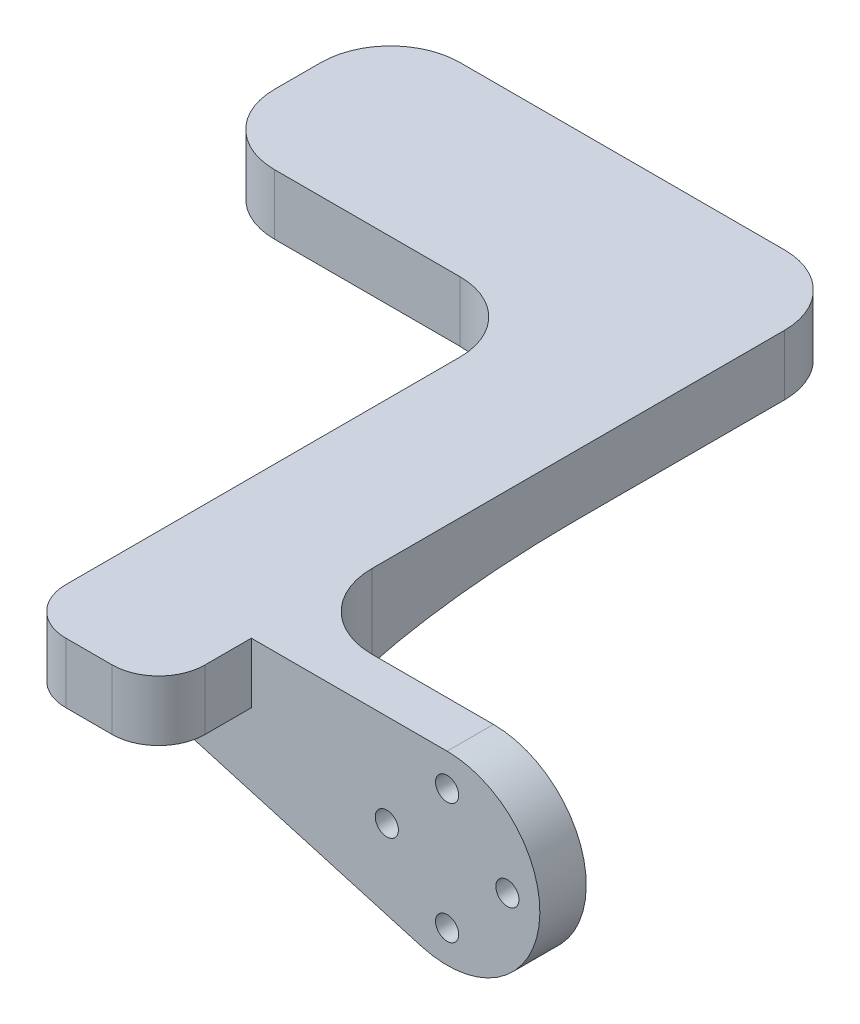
ISO-10303-21;
HEADER;
FILE_DESCRIPTION(('STEP AP214'),'2;1');
FILE_NAME('part.step','',(''),(''),'','','');
FILE_SCHEMA(('AUTOMOTIVE_DESIGN { 1 0 10303 214 1 1 1 1 }'));
ENDSEC;
DATA;
#1=APPLICATION_CONTEXT('core data for automotive mechanical design processes');
#2=APPLICATION_PROTOCOL_DEFINITION('international standard','automotive_design',2000,#1);
#3=PRODUCT_CONTEXT('',#1,'mechanical');
#4=PRODUCT('Part','Part','',(#3));
#5=PRODUCT_RELATED_PRODUCT_CATEGORY('part','',(#4));
#6=PRODUCT_DEFINITION_FORMATION('','',#4);
#7=PRODUCT_DEFINITION_CONTEXT('part definition',#1,'design');
#8=PRODUCT_DEFINITION('design','',#6,#7);
#9=PRODUCT_DEFINITION_SHAPE('','',#8);
#10=(LENGTH_UNIT() NAMED_UNIT(*) SI_UNIT(.MILLI.,.METRE.));
#11=(NAMED_UNIT(*) PLANE_ANGLE_UNIT() SI_UNIT($,.RADIAN.));
#12=(NAMED_UNIT(*) SI_UNIT($,.STERADIAN.) SOLID_ANGLE_UNIT());
#13=UNCERTAINTY_MEASURE_WITH_UNIT(LENGTH_MEASURE(1.E-05),#10,'distance_accuracy_value','');
#14=(GEOMETRIC_REPRESENTATION_CONTEXT(3) GLOBAL_UNCERTAINTY_ASSIGNED_CONTEXT((#13)) GLOBAL_UNIT_ASSIGNED_CONTEXT((#10,
#11,#12)) REPRESENTATION_CONTEXT('',''));
#15=CARTESIAN_POINT('',(0.,0.,0.));
#16=DIRECTION('',(0.,0.,1.));
#17=DIRECTION('',(1.,0.,0.));
#18=AXIS2_PLACEMENT_3D('',#15,#16,#17);
#19=CARTESIAN_POINT('',(0.,0.,5.));
#20=DIRECTION('',(0.,0.,-1.));
#21=DIRECTION('',(-1.,0.,0.));
#22=AXIS2_PLACEMENT_3D('',#19,#20,#21);
#23=CYLINDRICAL_SURFACE('',#22,10.);
#24=CARTESIAN_POINT('',(0.,0.,5.));
#25=DIRECTION('',(0.,0.,1.));
#26=DIRECTION('',(1.,0.,0.));
#27=AXIS2_PLACEMENT_3D('',#24,#25,#26);
#28=CIRCLE('',#27,10.);
#29=CARTESIAN_POINT('',(-2.76737364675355,-9.60945592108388,5.));
#30=VERTEX_POINT('',#29);
#31=CARTESIAN_POINT('',(0.,10.,5.));
#32=VERTEX_POINT('',#31);
#33=EDGE_CURVE('E449',#30,#32,#28,.T.);
#34=ORIENTED_EDGE('',*,*,#33,.F.);
#35=DIRECTION('',(0.,0.,1.));
#36=VECTOR('',#35,1.);
#37=CARTESIAN_POINT('',(-2.76737364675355,-9.60945592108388,-41.0909097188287));
#38=LINE('',#37,#36);
#39=CARTESIAN_POINT('',(-2.76737364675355,-9.60945592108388,0.));
#40=VERTEX_POINT('',#39);
#41=EDGE_CURVE('E452',#40,#30,#38,.T.);
#42=ORIENTED_EDGE('',*,*,#41,.F.);
#43=CARTESIAN_POINT('',(0.,0.,0.));
#44=DIRECTION('',(0.,0.,1.));
#45=DIRECTION('',(1.,0.,0.));
#46=AXIS2_PLACEMENT_3D('',#43,#44,#45);
#47=CIRCLE('',#46,10.);
#48=CARTESIAN_POINT('',(0.,10.,0.));
#49=VERTEX_POINT('',#48);
#50=EDGE_CURVE('E458',#40,#49,#47,.T.);
#51=ORIENTED_EDGE('',*,*,#50,.T.);
#52=DIRECTION('',(0.,0.,1.));
#53=VECTOR('',#52,1.);
#54=CARTESIAN_POINT('',(0.,10.,-41.0909097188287));
#55=LINE('',#54,#53);
#56=EDGE_CURVE('E455',#49,#32,#55,.T.);
#57=ORIENTED_EDGE('',*,*,#56,.T.);
#58=EDGE_LOOP('',(#34,#42,#51,#57));
#59=FACE_BOUND('',#58,.T.);
#60=ADVANCED_FACE('F44',(#59),#23,.T.);
#61=CARTESIAN_POINT('',(0.,0.,5.));
#62=DIRECTION('',(0.,0.,1.));
#63=DIRECTION('',(1.,0.,0.));
#64=AXIS2_PLACEMENT_3D('',#61,#62,#63);
#65=PLANE('',#64);
#66=DIRECTION('',(0.,-1.,0.));
#67=VECTOR('',#66,1.);
#68=CARTESIAN_POINT('',(-36.11,10.,5.));
#69=LINE('',#68,#67);
#70=CARTESIAN_POINT('',(-36.11,3.5,5.));
#71=VERTEX_POINT('',#70);
#72=CARTESIAN_POINT('',(-36.11,2.25067283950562,5.));
#73=VERTEX_POINT('',#72);
#74=EDGE_CURVE('E462',#71,#73,#69,.T.);
#75=ORIENTED_EDGE('',*,*,#74,.T.);
#76=CARTESIAN_POINT('',(-33.11,2.25067283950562,5.));
#77=DIRECTION('',(0.,0.,1.));
#78=DIRECTION('',(1.,0.,0.));
#79=AXIS2_PLACEMENT_3D('',#76,#77,#78);
#80=CIRCLE('',#79,3.);
#81=CARTESIAN_POINT('',(-33.9402120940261,-0.632163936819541,5.));
#82=VERTEX_POINT('',#81);
#83=EDGE_CURVE('E541',#73,#82,#80,.T.);
#84=ORIENTED_EDGE('',*,*,#83,.T.);
#85=DIRECTION('',(0.960945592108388,-0.276737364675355,0.));
#86=VECTOR('',#85,1.);
#87=CARTESIAN_POINT('',(-36.11,-0.00729881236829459,5.));
#88=LINE('',#87,#86);
#89=EDGE_CURVE('E278',#82,#30,#88,.T.);
#90=ORIENTED_EDGE('',*,*,#89,.T.);
#91=ORIENTED_EDGE('',*,*,#33,.T.);
#92=DIRECTION('',(-1.,0.,0.));
#93=VECTOR('',#92,1.);
#94=CARTESIAN_POINT('',(0.,10.,5.));
#95=LINE('',#94,#93);
#96=CARTESIAN_POINT('',(-21.11,10.,5.));
#97=VERTEX_POINT('',#96);
#98=EDGE_CURVE('E466',#32,#97,#95,.T.);
#99=ORIENTED_EDGE('',*,*,#98,.T.);
#100=DIRECTION('',(0.,1.,0.));
#101=VECTOR('',#100,1.);
#102=CARTESIAN_POINT('',(-21.11,0.,5.));
#103=LINE('',#102,#101);
#104=CARTESIAN_POINT('',(-21.11,3.5,5.));
#105=VERTEX_POINT('',#104);
#106=EDGE_CURVE('E273',#105,#97,#103,.T.);
#107=ORIENTED_EDGE('',*,*,#106,.F.);
#108=DIRECTION('',(-1.,0.,0.));
#109=VECTOR('',#108,1.);
#110=CARTESIAN_POINT('',(0.,3.5,5.));
#111=LINE('',#110,#109);
#112=EDGE_CURVE('E276',#105,#71,#111,.T.);
#113=ORIENTED_EDGE('',*,*,#112,.T.);
#114=EDGE_LOOP('',(#75,#84,#90,#91,#99,#107,#113));
#115=FACE_BOUND('',#114,.T.);
#116=CARTESIAN_POINT('',(0.,6.5,5.));
#117=DIRECTION('',(0.,0.,1.));
#118=DIRECTION('',(1.,0.,0.));
#119=AXIS2_PLACEMENT_3D('',#116,#117,#118);
#120=CIRCLE('',#119,1.25);
#121=CARTESIAN_POINT('',(1.25,6.5,5.));
#122=VERTEX_POINT('',#121);
#123=EDGE_CURVE('E479',#122,#122,#120,.T.);
#124=ORIENTED_EDGE('',*,*,#123,.F.);
#125=EDGE_LOOP('',(#124));
#126=FACE_BOUND('',#125,.T.);
#127=CARTESIAN_POINT('',(6.5,0.,5.));
#128=DIRECTION('',(0.,0.,1.));
#129=DIRECTION('',(1.,0.,0.));
#130=AXIS2_PLACEMENT_3D('',#127,#128,#129);
#131=CIRCLE('',#130,1.25);
#132=CARTESIAN_POINT('',(7.75,0.,5.));
#133=VERTEX_POINT('',#132);
#134=EDGE_CURVE('E482',#133,#133,#131,.T.);
#135=ORIENTED_EDGE('',*,*,#134,.F.);
#136=EDGE_LOOP('',(#135));
#137=FACE_BOUND('',#136,.T.);
#138=CARTESIAN_POINT('',(0.,-6.5,5.));
#139=DIRECTION('',(0.,0.,1.));
#140=DIRECTION('',(1.,0.,0.));
#141=AXIS2_PLACEMENT_3D('',#138,#139,#140);
#142=CIRCLE('',#141,1.25);
#143=CARTESIAN_POINT('',(1.25,-6.5,5.));
#144=VERTEX_POINT('',#143);
#145=EDGE_CURVE('E488',#144,#144,#142,.T.);
#146=ORIENTED_EDGE('',*,*,#145,.F.);
#147=EDGE_LOOP('',(#146));
#148=FACE_BOUND('',#147,.T.);
#149=CARTESIAN_POINT('',(-6.5,0.,5.));
#150=DIRECTION('',(0.,0.,1.));
#151=DIRECTION('',(1.,0.,0.));
#152=AXIS2_PLACEMENT_3D('',#149,#150,#151);
#153=CIRCLE('',#152,1.25);
#154=CARTESIAN_POINT('',(-5.25,0.,5.));
#155=VERTEX_POINT('',#154);
#156=EDGE_CURVE('E494',#155,#155,#153,.T.);
#157=ORIENTED_EDGE('',*,*,#156,.F.);
#158=EDGE_LOOP('',(#157));
#159=FACE_BOUND('',#158,.T.);
#160=ADVANCED_FACE('F314',(#115,#126,#137,#148,#159),#65,.T.);
#161=CARTESIAN_POINT('',(0.,0.,0.));
#162=DIRECTION('',(0.,0.,1.));
#163=DIRECTION('',(1.,0.,0.));
#164=AXIS2_PLACEMENT_3D('',#161,#162,#163);
#165=PLANE('',#164);
#166=CARTESIAN_POINT('',(0.,0.,0.));
#167=DIRECTION('',(0.,0.,-1.));
#168=DIRECTION('',(-1.,0.,0.));
#169=AXIS2_PLACEMENT_3D('',#166,#167,#168);
#170=CIRCLE('',#169,2.5);
#171=CARTESIAN_POINT('',(-2.5,0.,0.));
#172=VERTEX_POINT('',#171);
#173=EDGE_CURVE('E289',#172,#172,#170,.T.);
#174=ORIENTED_EDGE('',*,*,#173,.F.);
#175=EDGE_LOOP('',(#174));
#176=FACE_BOUND('',#175,.T.);
#177=CARTESIAN_POINT('',(0.,6.5,0.));
#178=DIRECTION('',(0.,0.,1.));
#179=DIRECTION('',(1.,0.,0.));
#180=AXIS2_PLACEMENT_3D('',#177,#178,#179);
#181=CIRCLE('',#180,1.25);
#182=CARTESIAN_POINT('',(1.25,6.5,0.));
#183=VERTEX_POINT('',#182);
#184=EDGE_CURVE('E476',#183,#183,#181,.T.);
#185=ORIENTED_EDGE('',*,*,#184,.T.);
#186=EDGE_LOOP('',(#185));
#187=FACE_BOUND('',#186,.T.);
#188=CARTESIAN_POINT('',(6.5,0.,0.));
#189=DIRECTION('',(0.,0.,1.));
#190=DIRECTION('',(1.,0.,0.));
#191=AXIS2_PLACEMENT_3D('',#188,#189,#190);
#192=CIRCLE('',#191,1.25);
#193=CARTESIAN_POINT('',(7.75,0.,0.));
#194=VERTEX_POINT('',#193);
#195=EDGE_CURVE('E485',#194,#194,#192,.T.);
#196=ORIENTED_EDGE('',*,*,#195,.T.);
#197=EDGE_LOOP('',(#196));
#198=FACE_BOUND('',#197,.T.);
#199=CARTESIAN_POINT('',(0.,-6.5,0.));
#200=DIRECTION('',(0.,0.,1.));
#201=DIRECTION('',(1.,0.,0.));
#202=AXIS2_PLACEMENT_3D('',#199,#200,#201);
#203=CIRCLE('',#202,1.25);
#204=CARTESIAN_POINT('',(1.25,-6.5,0.));
#205=VERTEX_POINT('',#204);
#206=EDGE_CURVE('E491',#205,#205,#203,.T.);
#207=ORIENTED_EDGE('',*,*,#206,.T.);
#208=EDGE_LOOP('',(#207));
#209=FACE_BOUND('',#208,.T.);
#210=CARTESIAN_POINT('',(-6.5,0.,0.));
#211=DIRECTION('',(0.,0.,1.));
#212=DIRECTION('',(1.,0.,0.));
#213=AXIS2_PLACEMENT_3D('',#210,#211,#212);
#214=CIRCLE('',#213,1.25);
#215=CARTESIAN_POINT('',(-5.25,0.,0.));
#216=VERTEX_POINT('',#215);
#217=EDGE_CURVE('E473',#216,#216,#214,.T.);
#218=ORIENTED_EDGE('',*,*,#217,.T.);
#219=EDGE_LOOP('',(#218));
#220=FACE_BOUND('',#219,.T.);
#221=CARTESIAN_POINT('',(-13.1100000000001,-4.,0.));
#222=CARTESIAN_POINT('',(-15.5266666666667,-4.,0.));
#223=CARTESIAN_POINT('',(-17.9433333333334,-4.,0.));
#224=CARTESIAN_POINT('',(-20.36,-4.,0.));
#225=CARTESIAN_POINT('',(-25.86,-4.,0.));
#226=CARTESIAN_POINT('',(-31.36,-4.,0.));
#227=CARTESIAN_POINT('',(-36.86,-4.,0.));
#228=(BOUNDED_CURVE() B_SPLINE_CURVE(3,(#221,#222,#223,#224,#225,#226,#227),.UNSPECIFIED.,.F.,
.F.) B_SPLINE_CURVE_WITH_KNOTS((4,3,4),(-0.03686,-0.0296100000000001,-0.0131100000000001),
.UNSPECIFIED.) CURVE() GEOMETRIC_REPRESENTATION_ITEM() RATIONAL_B_SPLINE_CURVE((1.,1.,1.,1.,1.,
1.,1.)) REPRESENTATION_ITEM(''));
#229=CARTESIAN_POINT('',(-21.11,-4.,0.));
#230=VERTEX_POINT('',#229);
#231=CARTESIAN_POINT('',(-13.1100000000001,-4.,0.));
#232=VERTEX_POINT('',#231);
#233=EDGE_CURVE('E62',#230,#232,#228,.F.);
#234=ORIENTED_EDGE('',*,*,#233,.T.);
#235=DIRECTION('',(0.,1.,0.));
#236=VECTOR('',#235,1.);
#237=CARTESIAN_POINT('',(-13.11,0.,0.));
#238=LINE('',#237,#236);
#239=CARTESIAN_POINT('',(-13.11,10.,0.));
#240=VERTEX_POINT('',#239);
#241=EDGE_CURVE('E324',#232,#240,#238,.T.);
#242=ORIENTED_EDGE('',*,*,#241,.T.);
#243=DIRECTION('',(1.,0.,0.));
#244=VECTOR('',#243,1.);
#245=CARTESIAN_POINT('',(0.,10.,0.));
#246=LINE('',#245,#244);
#247=EDGE_CURVE('E279',#240,#49,#246,.T.);
#248=ORIENTED_EDGE('',*,*,#247,.T.);
#249=ORIENTED_EDGE('',*,*,#50,.F.);
#250=DIRECTION('',(-0.960945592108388,0.276737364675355,0.));
#251=VECTOR('',#250,1.);
#252=CARTESIAN_POINT('',(-36.11,-0.00729881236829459,0.));
#253=LINE('',#252,#251);
#254=CARTESIAN_POINT('',(-22.245704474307,-3.99999999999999,0.));
#255=VERTEX_POINT('',#254);
#256=EDGE_CURVE('E281',#40,#255,#253,.T.);
#257=ORIENTED_EDGE('',*,*,#256,.T.);
#258=CARTESIAN_POINT('',(-13.1100000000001,-4.,0.));
#259=CARTESIAN_POINT('',(-15.5266666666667,-4.,0.));
#260=CARTESIAN_POINT('',(-17.9433333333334,-4.,0.));
#261=CARTESIAN_POINT('',(-20.36,-4.,0.));
#262=CARTESIAN_POINT('',(-25.86,-4.,0.));
#263=CARTESIAN_POINT('',(-31.36,-4.,0.));
#264=CARTESIAN_POINT('',(-36.86,-4.,0.));
#265=(BOUNDED_CURVE() B_SPLINE_CURVE(3,(#258,#259,#260,#261,#262,#263,#264),.UNSPECIFIED.,.F.,
.F.) B_SPLINE_CURVE_WITH_KNOTS((4,3,4),(-0.03686,-0.0296100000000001,-0.0131100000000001),
.UNSPECIFIED.) CURVE() GEOMETRIC_REPRESENTATION_ITEM() RATIONAL_B_SPLINE_CURVE((1.,1.,1.,1.,1.,
1.,1.)) REPRESENTATION_ITEM(''));
#266=EDGE_CURVE('E296',#255,#230,#265,.F.);
#267=ORIENTED_EDGE('',*,*,#266,.T.);
#268=EDGE_LOOP('',(#234,#242,#248,#249,#257,#267));
#269=FACE_BOUND('',#268,.T.);
#270=ADVANCED_FACE('F303',(#176,#187,#198,#209,#220,#269),#165,.F.);
#271=CARTESIAN_POINT('',(-6.5,0.,0.));
#272=DIRECTION('',(0.,0.,1.));
#273=DIRECTION('',(1.,0.,0.));
#274=AXIS2_PLACEMENT_3D('',#271,#272,#273);
#275=CYLINDRICAL_SURFACE('',#274,1.25);
#276=ORIENTED_EDGE('',*,*,#217,.F.);
#277=EDGE_LOOP('',(#276));
#278=FACE_BOUND('',#277,.T.);
#279=ORIENTED_EDGE('',*,*,#156,.T.);
#280=EDGE_LOOP('',(#279));
#281=FACE_BOUND('',#280,.T.);
#282=ADVANCED_FACE('F313',(#278,#281),#275,.F.);
#283=CARTESIAN_POINT('',(0.,-6.5,0.));
#284=DIRECTION('',(0.,0.,1.));
#285=DIRECTION('',(1.,0.,0.));
#286=AXIS2_PLACEMENT_3D('',#283,#284,#285);
#287=CYLINDRICAL_SURFACE('',#286,1.25);
#288=ORIENTED_EDGE('',*,*,#206,.F.);
#289=EDGE_LOOP('',(#288));
#290=FACE_BOUND('',#289,.T.);
#291=ORIENTED_EDGE('',*,*,#145,.T.);
#292=EDGE_LOOP('',(#291));
#293=FACE_BOUND('',#292,.T.);
#294=ADVANCED_FACE('F430',(#290,#293),#287,.F.);
#295=CARTESIAN_POINT('',(6.5,0.,0.));
#296=DIRECTION('',(0.,0.,1.));
#297=DIRECTION('',(1.,0.,0.));
#298=AXIS2_PLACEMENT_3D('',#295,#296,#297);
#299=CYLINDRICAL_SURFACE('',#298,1.25);
#300=ORIENTED_EDGE('',*,*,#195,.F.);
#301=EDGE_LOOP('',(#300));
#302=FACE_BOUND('',#301,.T.);
#303=ORIENTED_EDGE('',*,*,#134,.T.);
#304=EDGE_LOOP('',(#303));
#305=FACE_BOUND('',#304,.T.);
#306=ADVANCED_FACE('F426',(#302,#305),#299,.F.);
#307=CARTESIAN_POINT('',(0.,6.5,0.));
#308=DIRECTION('',(0.,0.,1.));
#309=DIRECTION('',(1.,0.,0.));
#310=AXIS2_PLACEMENT_3D('',#307,#308,#309);
#311=CYLINDRICAL_SURFACE('',#310,1.25);
#312=ORIENTED_EDGE('',*,*,#184,.F.);
#313=EDGE_LOOP('',(#312));
#314=FACE_BOUND('',#313,.T.);
#315=ORIENTED_EDGE('',*,*,#123,.T.);
#316=EDGE_LOOP('',(#315));
#317=FACE_BOUND('',#316,.T.);
#318=ADVANCED_FACE('F422',(#314,#317),#311,.F.);
#319=CARTESIAN_POINT('',(0.,0.,2.));
#320=DIRECTION('',(0.,0.,-1.));
#321=DIRECTION('',(-1.,0.,0.));
#322=AXIS2_PLACEMENT_3D('',#319,#320,#321);
#323=CYLINDRICAL_SURFACE('',#322,2.5);
#324=CARTESIAN_POINT('',(0.,0.,2.));
#325=DIRECTION('',(0.,0.,-1.));
#326=DIRECTION('',(-1.,0.,0.));
#327=AXIS2_PLACEMENT_3D('',#324,#325,#326);
#328=CIRCLE('',#327,2.5);
#329=CARTESIAN_POINT('',(-2.5,0.,2.));
#330=VERTEX_POINT('',#329);
#331=EDGE_CURVE('E470',#330,#330,#328,.T.);
#332=ORIENTED_EDGE('',*,*,#331,.F.);
#333=EDGE_LOOP('',(#332));
#334=FACE_BOUND('',#333,.T.);
#335=ORIENTED_EDGE('',*,*,#173,.T.);
#336=EDGE_LOOP('',(#335));
#337=FACE_BOUND('',#336,.T.);
#338=ADVANCED_FACE('F418',(#334,#337),#323,.F.);
#339=CARTESIAN_POINT('',(0.,0.,2.));
#340=DIRECTION('',(0.,0.,-1.));
#341=DIRECTION('',(-1.,0.,0.));
#342=AXIS2_PLACEMENT_3D('',#339,#340,#341);
#343=PLANE('',#342);
#344=ORIENTED_EDGE('',*,*,#331,.T.);
#345=EDGE_LOOP('',(#344));
#346=FACE_BOUND('',#345,.T.);
#347=ADVANCED_FACE('F414',(#346),#343,.T.);
#348=CARTESIAN_POINT('',(-36.11,-0.00729881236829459,-41.0909097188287));
#349=DIRECTION('',(-0.276737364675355,-0.960945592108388,0.));
#350=DIRECTION('',(0.960945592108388,-0.276737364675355,0.));
#351=AXIS2_PLACEMENT_3D('',#348,#349,#350);
#352=PLANE('',#351);
#353=ORIENTED_EDGE('',*,*,#89,.F.);
#354=DIRECTION('',(0.,0.,1.));
#355=VECTOR('',#354,1.);
#356=CARTESIAN_POINT('',(-33.9402120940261,-0.632163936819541,-41.0909097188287));
#357=LINE('',#356,#355);
#358=CARTESIAN_POINT('',(-33.9399202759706,-0.632220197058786,-3.19396303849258));
#359=VERTEX_POINT('',#358);
#360=EDGE_CURVE('E543',#82,#359,#357,.F.);
#361=ORIENTED_EDGE('',*,*,#360,.T.);
#362=CARTESIAN_POINT('',(-22.245704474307,-4.,0.));
#363=CARTESIAN_POINT('',(-22.4658468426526,-3.9366439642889,-1.25286731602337E-05));
#364=CARTESIAN_POINT('',(-22.6860288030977,-3.87342256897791,-0.00321291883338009));
#365=CARTESIAN_POINT('',(-23.1619909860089,-3.73689197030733,-0.0170231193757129));
#366=CARTESIAN_POINT('',(-23.4177473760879,-3.66361130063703,-0.028751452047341));
#367=CARTESIAN_POINT('',(-23.964907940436,-3.50673185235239,-0.0630821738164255));
#368=CARTESIAN_POINT('',(-24.2562331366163,-3.4231409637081,-0.086988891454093));
#369=CARTESIAN_POINT('',(-24.874612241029,-3.24549154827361,-0.149801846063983));
#370=CARTESIAN_POINT('',(-25.201517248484,-3.15144839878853,-0.190224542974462));
#371=CARTESIAN_POINT('',(-25.8911560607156,-2.95278984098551,-0.29087667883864));
#372=CARTESIAN_POINT('',(-26.2536462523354,-2.84821375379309,-0.352860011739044));
#373=CARTESIAN_POINT('',(-27.014575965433,-2.62850669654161,-0.502139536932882));
#374=CARTESIAN_POINT('',(-27.412644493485,-2.51346280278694,-0.591453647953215));
#375=CARTESIAN_POINT('',(-28.2449196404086,-2.27295811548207,-0.801645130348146));
#376=CARTESIAN_POINT('',(-28.6785920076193,-2.14765454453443,-0.924835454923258));
#377=CARTESIAN_POINT('',(-29.2432329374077,-1.98485627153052,-1.1027148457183));
#378=CARTESIAN_POINT('',(-29.3774396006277,-1.9461876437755,-1.14630868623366));
#379=CARTESIAN_POINT('',(-29.7821363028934,-1.82959203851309,-1.28180247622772));
#380=CARTESIAN_POINT('',(-30.0514785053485,-1.75200462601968,-1.37746348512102));
#381=CARTESIAN_POINT('',(-30.6636366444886,-1.57562990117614,-1.60751517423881));
#382=CARTESIAN_POINT('',(-31.0053306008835,-1.47715577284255,-1.74513707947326));
#383=CARTESIAN_POINT('',(-31.6413364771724,-1.29398769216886,-2.01833136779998));
#384=CARTESIAN_POINT('',(-31.9363552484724,-1.20907482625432,-2.1521159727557));
#385=CARTESIAN_POINT('',(-32.4654297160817,-1.05680480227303,-2.40491646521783));
#386=CARTESIAN_POINT('',(-32.7003890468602,-0.989185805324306,-2.52188823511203));
#387=CARTESIAN_POINT('',(-33.2728939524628,-0.824381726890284,-2.81855774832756));
#388=CARTESIAN_POINT('',(-33.6083861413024,-0.727768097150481,-3.00254525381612));
#389=CARTESIAN_POINT('',(-33.939627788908,-0.632276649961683,-3.19449625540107));
#390=B_SPLINE_CURVE_WITH_KNOTS('',3,(#362,#363,#364,#365,#366,#367,#368,#369,#370,#371,#372,
#373,#374,#375,#376,#377,#378,#379,#380,#381,#382,#383,#384,#385,#386,#387,#388,#389),
.UNSPECIFIED.,.F.,.F.,(4,2,2,2,2,2,2,2,2,2,2,2,2,4),(0.,0.68721450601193,1.48599367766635,
2.39785055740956,3.42521856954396,4.5717848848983,5.84286551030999,7.24578638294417,
7.68471162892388,8.57302069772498,9.7165314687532,10.720916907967,11.5338980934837,
12.717425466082),.UNSPECIFIED.);
#391=EDGE_CURVE('E553',#359,#255,#390,.F.);
#392=ORIENTED_EDGE('',*,*,#391,.T.);
#393=ORIENTED_EDGE('',*,*,#256,.F.);
#394=ORIENTED_EDGE('',*,*,#41,.T.);
#395=EDGE_LOOP('',(#353,#361,#392,#393,#394));
#396=FACE_BOUND('',#395,.T.);
#397=ADVANCED_FACE('F401',(#396),#352,.T.);
#398=CARTESIAN_POINT('',(-36.11,10.,-41.0909097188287));
#399=DIRECTION('',(-1.,0.,0.));
#400=DIRECTION('',(0.,0.,1.));
#401=AXIS2_PLACEMENT_3D('',#398,#399,#400);
#402=PLANE('',#401);
#403=CARTESIAN_POINT('',(-36.11,-4.,0.));
#404=CARTESIAN_POINT('',(-36.11,3.5,0.));
#405=CARTESIAN_POINT('',(-36.11,3.5,-30.));
#406=(BOUNDED_CURVE() B_SPLINE_CURVE(2,(#403,#404,#405),.UNSPECIFIED.,.F.,
.F.) B_SPLINE_CURVE_WITH_KNOTS((3,3),(0.,1.),
.UNSPECIFIED.) CURVE() GEOMETRIC_REPRESENTATION_ITEM() RATIONAL_B_SPLINE_CURVE((1.,
0.707106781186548,1.)) REPRESENTATION_ITEM(''));
#407=CARTESIAN_POINT('',(-36.11,3.5,-30.));
#408=VERTEX_POINT('',#407);
#409=CARTESIAN_POINT('',(-36.11,2.25053904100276,-13.4192978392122));
#410=VERTEX_POINT('',#409);
#411=EDGE_CURVE('E618',#408,#410,#406,.F.);
#412=ORIENTED_EDGE('',*,*,#411,.T.);
#413=DIRECTION('',(0.,0.,1.));
#414=VECTOR('',#413,1.);
#415=CARTESIAN_POINT('',(-36.11,2.25067283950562,-41.0909097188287));
#416=LINE('',#415,#414);
#417=EDGE_CURVE('E540',#410,#73,#416,.T.);
#418=ORIENTED_EDGE('',*,*,#417,.T.);
#419=ORIENTED_EDGE('',*,*,#74,.F.);
#420=DIRECTION('',(0.,0.,1.));
#421=VECTOR('',#420,1.);
#422=CARTESIAN_POINT('',(-36.11,3.5,-40.));
#423=LINE('',#422,#421);
#424=CARTESIAN_POINT('',(-36.11,3.5,10.));
#425=VERTEX_POINT('',#424);
#426=EDGE_CURVE('E222',#71,#425,#423,.T.);
#427=ORIENTED_EDGE('',*,*,#426,.T.);
#428=DIRECTION('',(0.,1.,0.));
#429=VECTOR('',#428,1.);
#430=CARTESIAN_POINT('',(-36.11,3.5,10.));
#431=LINE('',#430,#429);
#432=CARTESIAN_POINT('',(-36.11,10.,10.));
#433=VERTEX_POINT('',#432);
#434=EDGE_CURVE('E234',#425,#433,#431,.T.);
#435=ORIENTED_EDGE('',*,*,#434,.T.);
#436=DIRECTION('',(0.,0.,1.));
#437=VECTOR('',#436,1.);
#438=CARTESIAN_POINT('',(-36.11,10.,-41.0909097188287));
#439=LINE('',#438,#437);
#440=CARTESIAN_POINT('',(-36.11,10.,-32.5));
#441=VERTEX_POINT('',#440);
#442=EDGE_CURVE('E197',#441,#433,#439,.T.);
#443=ORIENTED_EDGE('',*,*,#442,.F.);
#444=DIRECTION('',(0.,1.,0.));
#445=VECTOR('',#444,1.);
#446=CARTESIAN_POINT('',(-36.11,3.5,-32.5));
#447=LINE('',#446,#445);
#448=CARTESIAN_POINT('',(-36.11,3.5,-32.5));
#449=VERTEX_POINT('',#448);
#450=EDGE_CURVE('E267',#441,#449,#447,.F.);
#451=ORIENTED_EDGE('',*,*,#450,.T.);
#452=EDGE_CURVE('E218',#449,#408,#423,.T.);
#453=ORIENTED_EDGE('',*,*,#452,.T.);
#454=EDGE_LOOP('',(#412,#418,#419,#427,#435,#443,#451,#453));
#455=FACE_BOUND('',#454,.T.);
#456=ADVANCED_FACE('F397',(#455),#402,.T.);
#457=CARTESIAN_POINT('',(0.,10.,-41.0909097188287));
#458=DIRECTION('',(0.,1.,0.));
#459=DIRECTION('',(0.,0.,1.));
#460=AXIS2_PLACEMENT_3D('',#457,#458,#459);
#461=PLANE('',#460);
#462=ORIENTED_EDGE('',*,*,#247,.F.);
#463=CARTESIAN_POINT('',(-13.11,10.,-8.));
#464=DIRECTION('',(0.,1.,0.));
#465=DIRECTION('',(0.,0.,1.));
#466=AXIS2_PLACEMENT_3D('',#463,#464,#465);
#467=CIRCLE('',#466,8.);
#468=CARTESIAN_POINT('',(-21.11,10.,-8.));
#469=VERTEX_POINT('',#468);
#470=EDGE_CURVE('E55',#240,#469,#467,.F.);
#471=ORIENTED_EDGE('',*,*,#470,.T.);
#472=DIRECTION('',(0.,0.,-1.));
#473=VECTOR('',#472,1.);
#474=CARTESIAN_POINT('',(-21.11,10.,15.));
#475=LINE('',#474,#473);
#476=CARTESIAN_POINT('',(-21.11,10.,-52.5));
#477=VERTEX_POINT('',#476);
#478=EDGE_CURVE('E212',#469,#477,#475,.T.);
#479=ORIENTED_EDGE('',*,*,#478,.T.);
#480=CARTESIAN_POINT('',(-28.61,10.,-52.5));
#481=DIRECTION('',(0.,1.,0.));
#482=DIRECTION('',(0.,0.,1.));
#483=AXIS2_PLACEMENT_3D('',#480,#481,#482);
#484=CIRCLE('',#483,7.5);
#485=CARTESIAN_POINT('',(-28.61,10.,-60.));
#486=VERTEX_POINT('',#485);
#487=EDGE_CURVE('E243',#477,#486,#484,.T.);
#488=ORIENTED_EDGE('',*,*,#487,.T.);
#489=DIRECTION('',(-1.,0.,0.));
#490=VECTOR('',#489,1.);
#491=CARTESIAN_POINT('',(-21.11,10.,-60.));
#492=LINE('',#491,#490);
#493=CARTESIAN_POINT('',(-63.61,10.,-60.));
#494=VERTEX_POINT('',#493);
#495=EDGE_CURVE('E522',#486,#494,#492,.T.);
#496=ORIENTED_EDGE('',*,*,#495,.T.);
#497=CARTESIAN_POINT('',(-63.61,10.,-52.5));
#498=DIRECTION('',(0.,1.,0.));
#499=DIRECTION('',(0.,0.,1.));
#500=AXIS2_PLACEMENT_3D('',#497,#498,#499);
#501=CIRCLE('',#500,7.5);
#502=CARTESIAN_POINT('',(-71.11,10.,-52.5));
#503=VERTEX_POINT('',#502);
#504=EDGE_CURVE('E245',#494,#503,#501,.T.);
#505=ORIENTED_EDGE('',*,*,#504,.T.);
#506=DIRECTION('',(0.,0.,1.));
#507=VECTOR('',#506,1.);
#508=CARTESIAN_POINT('',(-71.11,10.,-60.));
#509=LINE('',#508,#507);
#510=CARTESIAN_POINT('',(-71.11,10.,-47.5));
#511=VERTEX_POINT('',#510);
#512=EDGE_CURVE('E524',#503,#511,#509,.T.);
#513=ORIENTED_EDGE('',*,*,#512,.T.);
#514=CARTESIAN_POINT('',(-63.61,10.,-47.5));
#515=DIRECTION('',(0.,1.,0.));
#516=DIRECTION('',(0.,0.,1.));
#517=AXIS2_PLACEMENT_3D('',#514,#515,#516);
#518=CIRCLE('',#517,7.5);
#519=CARTESIAN_POINT('',(-63.61,10.,-40.));
#520=VERTEX_POINT('',#519);
#521=EDGE_CURVE('E241',#511,#520,#518,.T.);
#522=ORIENTED_EDGE('',*,*,#521,.T.);
#523=DIRECTION('',(1.,0.,0.));
#524=VECTOR('',#523,1.);
#525=CARTESIAN_POINT('',(-71.11,10.,-40.));
#526=LINE('',#525,#524);
#527=CARTESIAN_POINT('',(-43.61,10.,-40.));
#528=VERTEX_POINT('',#527);
#529=EDGE_CURVE('E225',#520,#528,#526,.T.);
#530=ORIENTED_EDGE('',*,*,#529,.T.);
#531=CARTESIAN_POINT('',(-43.61,10.,-32.5));
#532=DIRECTION('',(0.,1.,0.));
#533=DIRECTION('',(0.,0.,1.));
#534=AXIS2_PLACEMENT_3D('',#531,#532,#533);
#535=CIRCLE('',#534,7.5);
#536=EDGE_CURVE('E269',#528,#441,#535,.F.);
#537=ORIENTED_EDGE('',*,*,#536,.T.);
#538=ORIENTED_EDGE('',*,*,#442,.T.);
#539=CARTESIAN_POINT('',(-31.11,10.,10.));
#540=DIRECTION('',(0.,1.,0.));
#541=DIRECTION('',(0.,0.,1.));
#542=AXIS2_PLACEMENT_3D('',#539,#540,#541);
#543=CIRCLE('',#542,5.);
#544=CARTESIAN_POINT('',(-31.11,10.,15.));
#545=VERTEX_POINT('',#544);
#546=EDGE_CURVE('E192',#433,#545,#543,.T.);
#547=ORIENTED_EDGE('',*,*,#546,.T.);
#548=DIRECTION('',(1.,0.,0.));
#549=VECTOR('',#548,1.);
#550=CARTESIAN_POINT('',(-36.11,10.,15.));
#551=LINE('',#550,#549);
#552=CARTESIAN_POINT('',(-26.11,10.,15.));
#553=VERTEX_POINT('',#552);
#554=EDGE_CURVE('E195',#545,#553,#551,.T.);
#555=ORIENTED_EDGE('',*,*,#554,.T.);
#556=CARTESIAN_POINT('',(-26.11,10.,10.));
#557=DIRECTION('',(0.,1.,0.));
#558=DIRECTION('',(0.,0.,1.));
#559=AXIS2_PLACEMENT_3D('',#556,#557,#558);
#560=CIRCLE('',#559,5.);
#561=CARTESIAN_POINT('',(-21.11,10.,10.));
#562=VERTEX_POINT('',#561);
#563=EDGE_CURVE('E202',#553,#562,#560,.T.);
#564=ORIENTED_EDGE('',*,*,#563,.T.);
#565=EDGE_CURVE('E519',#562,#97,#475,.T.);
#566=ORIENTED_EDGE('',*,*,#565,.T.);
#567=ORIENTED_EDGE('',*,*,#98,.F.);
#568=ORIENTED_EDGE('',*,*,#56,.F.);
#569=EDGE_LOOP('',(#462,#471,#479,#488,#496,#505,#513,#522,#530,#537,#538,#547,#555,#564,#566,
#567,#568));
#570=FACE_BOUND('',#569,.T.);
#571=ADVANCED_FACE('F194',(#570),#461,.T.);
#572=CARTESIAN_POINT('',(-43.61,3.5,-32.5));
#573=DIRECTION('',(0.,-1.,0.));
#574=DIRECTION('',(0.,0.,-1.));
#575=AXIS2_PLACEMENT_3D('',#572,#573,#574);
#576=CYLINDRICAL_SURFACE('',#575,7.5);
#577=CARTESIAN_POINT('',(-43.61,3.5,-32.5));
#578=DIRECTION('',(0.,1.,0.));
#579=DIRECTION('',(0.,0.,1.));
#580=AXIS2_PLACEMENT_3D('',#577,#578,#579);
#581=CIRCLE('',#580,7.5);
#582=CARTESIAN_POINT('',(-43.61,3.5,-40.));
#583=VERTEX_POINT('',#582);
#584=EDGE_CURVE('E271',#449,#583,#581,.T.);
#585=ORIENTED_EDGE('',*,*,#584,.F.);
#586=ORIENTED_EDGE('',*,*,#450,.F.);
#587=ORIENTED_EDGE('',*,*,#536,.F.);
#588=DIRECTION('',(0.,1.,0.));
#589=VECTOR('',#588,1.);
#590=CARTESIAN_POINT('',(-43.61,10.,-40.));
#591=LINE('',#590,#589);
#592=EDGE_CURVE('E264',#583,#528,#591,.T.);
#593=ORIENTED_EDGE('',*,*,#592,.F.);
#594=EDGE_LOOP('',(#585,#586,#587,#593));
#595=FACE_BOUND('',#594,.T.);
#596=ADVANCED_FACE('F388',(#595),#576,.F.);
#597=CARTESIAN_POINT('',(-71.11,3.5,-40.));
#598=DIRECTION('',(0.,0.,1.));
#599=DIRECTION('',(1.,0.,0.));
#600=AXIS2_PLACEMENT_3D('',#597,#598,#599);
#601=PLANE('',#600);
#602=DIRECTION('',(1.,0.,0.));
#603=VECTOR('',#602,1.);
#604=CARTESIAN_POINT('',(-71.11,3.5,-40.));
#605=LINE('',#604,#603);
#606=CARTESIAN_POINT('',(-63.61,3.5,-40.));
#607=VERTEX_POINT('',#606);
#608=EDGE_CURVE('E515',#607,#583,#605,.T.);
#609=ORIENTED_EDGE('',*,*,#608,.T.);
#610=ORIENTED_EDGE('',*,*,#592,.T.);
#611=ORIENTED_EDGE('',*,*,#529,.F.);
#612=DIRECTION('',(0.,1.,0.));
#613=VECTOR('',#612,1.);
#614=CARTESIAN_POINT('',(-63.61,3.5,-40.));
#615=LINE('',#614,#613);
#616=EDGE_CURVE('E262',#520,#607,#615,.F.);
#617=ORIENTED_EDGE('',*,*,#616,.T.);
#618=EDGE_LOOP('',(#609,#610,#611,#617));
#619=FACE_BOUND('',#618,.T.);
#620=ADVANCED_FACE('F391',(#619),#601,.T.);
#621=CARTESIAN_POINT('',(-63.61,3.5,-47.5));
#622=DIRECTION('',(0.,1.,0.));
#623=DIRECTION('',(0.,0.,1.));
#624=AXIS2_PLACEMENT_3D('',#621,#622,#623);
#625=CYLINDRICAL_SURFACE('',#624,7.5);
#626=CARTESIAN_POINT('',(-63.61,3.5,-47.5));
#627=DIRECTION('',(0.,1.,0.));
#628=DIRECTION('',(0.,0.,1.));
#629=AXIS2_PLACEMENT_3D('',#626,#627,#628);
#630=CIRCLE('',#629,7.5);
#631=CARTESIAN_POINT('',(-71.11,3.5,-47.5));
#632=VERTEX_POINT('',#631);
#633=EDGE_CURVE('E252',#607,#632,#630,.F.);
#634=ORIENTED_EDGE('',*,*,#633,.F.);
#635=ORIENTED_EDGE('',*,*,#616,.F.);
#636=ORIENTED_EDGE('',*,*,#521,.F.);
#637=DIRECTION('',(0.,1.,0.));
#638=VECTOR('',#637,1.);
#639=CARTESIAN_POINT('',(-71.11,3.5,-47.5));
#640=LINE('',#639,#638);
#641=EDGE_CURVE('E247',#632,#511,#640,.T.);
#642=ORIENTED_EDGE('',*,*,#641,.F.);
#643=EDGE_LOOP('',(#634,#635,#636,#642));
#644=FACE_BOUND('',#643,.T.);
#645=ADVANCED_FACE('F393',(#644),#625,.T.);
#646=CARTESIAN_POINT('',(-71.11,3.5,-60.));
#647=DIRECTION('',(-1.,0.,0.));
#648=DIRECTION('',(0.,0.,1.));
#649=AXIS2_PLACEMENT_3D('',#646,#647,#648);
#650=PLANE('',#649);
#651=ORIENTED_EDGE('',*,*,#512,.F.);
#652=DIRECTION('',(0.,1.,0.));
#653=VECTOR('',#652,1.);
#654=CARTESIAN_POINT('',(-71.11,3.5,-52.5));
#655=LINE('',#654,#653);
#656=CARTESIAN_POINT('',(-71.11,3.5,-52.5));
#657=VERTEX_POINT('',#656);
#658=EDGE_CURVE('E250',#503,#657,#655,.F.);
#659=ORIENTED_EDGE('',*,*,#658,.T.);
#660=DIRECTION('',(0.,0.,1.));
#661=VECTOR('',#660,1.);
#662=CARTESIAN_POINT('',(-71.11,3.5,-60.));
#663=LINE('',#662,#661);
#664=EDGE_CURVE('E512',#657,#632,#663,.T.);
#665=ORIENTED_EDGE('',*,*,#664,.T.);
#666=ORIENTED_EDGE('',*,*,#641,.T.);
#667=EDGE_LOOP('',(#651,#659,#665,#666));
#668=FACE_BOUND('',#667,.T.);
#669=ADVANCED_FACE('F381',(#668),#650,.T.);
#670=CARTESIAN_POINT('',(-63.61,3.5,-52.5));
#671=DIRECTION('',(0.,1.,0.));
#672=DIRECTION('',(0.,0.,1.));
#673=AXIS2_PLACEMENT_3D('',#670,#671,#672);
#674=CYLINDRICAL_SURFACE('',#673,7.5);
#675=CARTESIAN_POINT('',(-63.61,3.5,-52.5));
#676=DIRECTION('',(0.,1.,0.));
#677=DIRECTION('',(0.,0.,1.));
#678=AXIS2_PLACEMENT_3D('',#675,#676,#677);
#679=CIRCLE('',#678,7.5);
#680=CARTESIAN_POINT('',(-63.61,3.5,-60.));
#681=VERTEX_POINT('',#680);
#682=EDGE_CURVE('E257',#657,#681,#679,.F.);
#683=ORIENTED_EDGE('',*,*,#682,.F.);
#684=ORIENTED_EDGE('',*,*,#658,.F.);
#685=ORIENTED_EDGE('',*,*,#504,.F.);
#686=DIRECTION('',(0.,1.,0.));
#687=VECTOR('',#686,1.);
#688=CARTESIAN_POINT('',(-63.61,3.5,-60.));
#689=LINE('',#688,#687);
#690=EDGE_CURVE('E238',#681,#494,#689,.T.);
#691=ORIENTED_EDGE('',*,*,#690,.F.);
#692=EDGE_LOOP('',(#683,#684,#685,#691));
#693=FACE_BOUND('',#692,.T.);
#694=ADVANCED_FACE('F378',(#693),#674,.T.);
#695=CARTESIAN_POINT('',(-21.11,3.5,-60.));
#696=DIRECTION('',(0.,0.,-1.));
#697=DIRECTION('',(-1.,0.,0.));
#698=AXIS2_PLACEMENT_3D('',#695,#696,#697);
#699=PLANE('',#698);
#700=DIRECTION('',(-1.,0.,0.));
#701=VECTOR('',#700,1.);
#702=CARTESIAN_POINT('',(-21.11,3.5,-60.));
#703=LINE('',#702,#701);
#704=CARTESIAN_POINT('',(-28.61,3.5,-60.));
#705=VERTEX_POINT('',#704);
#706=EDGE_CURVE('E509',#705,#681,#703,.T.);
#707=ORIENTED_EDGE('',*,*,#706,.T.);
#708=ORIENTED_EDGE('',*,*,#690,.T.);
#709=ORIENTED_EDGE('',*,*,#495,.F.);
#710=DIRECTION('',(0.,1.,0.));
#711=VECTOR('',#710,1.);
#712=CARTESIAN_POINT('',(-28.61,3.5,-60.));
#713=LINE('',#712,#711);
#714=EDGE_CURVE('E236',#486,#705,#713,.F.);
#715=ORIENTED_EDGE('',*,*,#714,.T.);
#716=EDGE_LOOP('',(#707,#708,#709,#715));
#717=FACE_BOUND('',#716,.T.);
#718=ADVANCED_FACE('F367',(#717),#699,.T.);
#719=CARTESIAN_POINT('',(-28.61,3.5,-52.5));
#720=DIRECTION('',(0.,1.,0.));
#721=DIRECTION('',(0.,0.,1.));
#722=AXIS2_PLACEMENT_3D('',#719,#720,#721);
#723=CYLINDRICAL_SURFACE('',#722,7.5);
#724=CARTESIAN_POINT('',(-28.61,3.5,-52.5));
#725=DIRECTION('',(0.,1.,0.));
#726=DIRECTION('',(0.,0.,1.));
#727=AXIS2_PLACEMENT_3D('',#724,#725,#726);
#728=CIRCLE('',#727,7.5);
#729=CARTESIAN_POINT('',(-21.11,3.5,-52.5));
#730=VERTEX_POINT('',#729);
#731=EDGE_CURVE('E254',#705,#730,#728,.F.);
#732=ORIENTED_EDGE('',*,*,#731,.F.);
#733=ORIENTED_EDGE('',*,*,#714,.F.);
#734=ORIENTED_EDGE('',*,*,#487,.F.);
#735=DIRECTION('',(0.,1.,0.));
#736=VECTOR('',#735,1.);
#737=CARTESIAN_POINT('',(-21.11,3.5,-52.5));
#738=LINE('',#737,#736);
#739=EDGE_CURVE('E259',#730,#477,#738,.T.);
#740=ORIENTED_EDGE('',*,*,#739,.F.);
#741=EDGE_LOOP('',(#732,#733,#734,#740));
#742=FACE_BOUND('',#741,.T.);
#743=ADVANCED_FACE('F383',(#742),#723,.T.);
#744=CARTESIAN_POINT('',(0.,3.5,0.));
#745=DIRECTION('',(0.,1.,0.));
#746=DIRECTION('',(0.,0.,1.));
#747=AXIS2_PLACEMENT_3D('',#744,#745,#746);
#748=PLANE('',#747);
#749=DIRECTION('',(0.,0.,-1.));
#750=VECTOR('',#749,1.);
#751=CARTESIAN_POINT('',(-21.11,3.5,15.));
#752=LINE('',#751,#750);
#753=CARTESIAN_POINT('',(-21.11,3.5,-30.));
#754=VERTEX_POINT('',#753);
#755=EDGE_CURVE('E500',#754,#730,#752,.T.);
#756=ORIENTED_EDGE('',*,*,#755,.F.);
#757=CARTESIAN_POINT('',(-36.86,3.5,-30.));
#758=CARTESIAN_POINT('',(-31.36,3.5,-30.));
#759=CARTESIAN_POINT('',(-25.86,3.5,-30.));
#760=CARTESIAN_POINT('',(-20.36,3.5,-30.));
#761=CARTESIAN_POINT('',(-17.9433333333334,3.5,-30.));
#762=CARTESIAN_POINT('',(-15.5266666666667,3.5,-30.));
#763=CARTESIAN_POINT('',(-13.1100000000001,3.5,-30.));
#764=(BOUNDED_CURVE() B_SPLINE_CURVE(3,(#757,#758,#759,#760,#761,#762,#763),.UNSPECIFIED.,.F.,
.F.) B_SPLINE_CURVE_WITH_KNOTS((4,3,4),(-0.03686,-0.02036,-0.0131100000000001),
.UNSPECIFIED.) CURVE() GEOMETRIC_REPRESENTATION_ITEM() RATIONAL_B_SPLINE_CURVE((1.,1.,1.,1.,1.,
1.,1.)) REPRESENTATION_ITEM(''));
#765=EDGE_CURVE('E457',#754,#408,#764,.F.);
#766=ORIENTED_EDGE('',*,*,#765,.T.);
#767=ORIENTED_EDGE('',*,*,#452,.F.);
#768=ORIENTED_EDGE('',*,*,#584,.T.);
#769=ORIENTED_EDGE('',*,*,#608,.F.);
#770=ORIENTED_EDGE('',*,*,#633,.T.);
#771=ORIENTED_EDGE('',*,*,#664,.F.);
#772=ORIENTED_EDGE('',*,*,#682,.T.);
#773=ORIENTED_EDGE('',*,*,#706,.F.);
#774=ORIENTED_EDGE('',*,*,#731,.T.);
#775=EDGE_LOOP('',(#756,#766,#767,#768,#769,#770,#771,#772,#773,#774));
#776=FACE_BOUND('',#775,.T.);
#777=ADVANCED_FACE('F386',(#776),#748,.F.);
#778=CARTESIAN_POINT('',(-21.11,3.5,15.));
#779=DIRECTION('',(1.,0.,0.));
#780=DIRECTION('',(0.,0.,-1.));
#781=AXIS2_PLACEMENT_3D('',#778,#779,#780);
#782=PLANE('',#781);
#783=ORIENTED_EDGE('',*,*,#478,.F.);
#784=DIRECTION('',(0.,1.,0.));
#785=VECTOR('',#784,1.);
#786=CARTESIAN_POINT('',(-21.11,3.5,-8.));
#787=LINE('',#786,#785);
#788=CARTESIAN_POINT('',(-21.11,1.09945512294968,-8.0001023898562));
#789=VERTEX_POINT('',#788);
#790=EDGE_CURVE('E332',#469,#789,#787,.F.);
#791=ORIENTED_EDGE('',*,*,#790,.T.);
#792=CARTESIAN_POINT('',(-21.11,3.5,-30.));
#793=CARTESIAN_POINT('',(-21.11,3.5,0.));
#794=CARTESIAN_POINT('',(-21.11,-4.,0.));
#795=(BOUNDED_CURVE() B_SPLINE_CURVE(2,(#792,#793,#794),.UNSPECIFIED.,.F.,
.F.) B_SPLINE_CURVE_WITH_KNOTS((3,3),(0.,1.),
.UNSPECIFIED.) CURVE() GEOMETRIC_REPRESENTATION_ITEM() RATIONAL_B_SPLINE_CURVE((1.,
0.707106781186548,1.)) REPRESENTATION_ITEM(''));
#796=EDGE_CURVE('E339',#789,#754,#795,.F.);
#797=ORIENTED_EDGE('',*,*,#796,.T.);
#798=ORIENTED_EDGE('',*,*,#755,.T.);
#799=ORIENTED_EDGE('',*,*,#739,.T.);
#800=EDGE_LOOP('',(#783,#791,#797,#798,#799));
#801=FACE_BOUND('',#800,.T.);
#802=ADVANCED_FACE('F366',(#801),#782,.T.);
#803=CARTESIAN_POINT('',(-36.11,3.5,15.));
#804=DIRECTION('',(0.,0.,1.));
#805=DIRECTION('',(1.,0.,0.));
#806=AXIS2_PLACEMENT_3D('',#803,#804,#805);
#807=PLANE('',#806);
#808=DIRECTION('',(1.,0.,0.));
#809=VECTOR('',#808,1.);
#810=CARTESIAN_POINT('',(-36.11,3.5,15.));
#811=LINE('',#810,#809);
#812=CARTESIAN_POINT('',(-31.11,3.5,15.));
#813=VERTEX_POINT('',#812);
#814=CARTESIAN_POINT('',(-26.11,3.5,15.));
#815=VERTEX_POINT('',#814);
#816=EDGE_CURVE('E503',#813,#815,#811,.T.);
#817=ORIENTED_EDGE('',*,*,#816,.T.);
#818=DIRECTION('',(0.,1.,0.));
#819=VECTOR('',#818,1.);
#820=CARTESIAN_POINT('',(-26.11,3.5,15.));
#821=LINE('',#820,#819);
#822=EDGE_CURVE('E203',#815,#553,#821,.T.);
#823=ORIENTED_EDGE('',*,*,#822,.T.);
#824=ORIENTED_EDGE('',*,*,#554,.F.);
#825=DIRECTION('',(0.,1.,0.));
#826=VECTOR('',#825,1.);
#827=CARTESIAN_POINT('',(-31.11,3.5,15.));
#828=LINE('',#827,#826);
#829=EDGE_CURVE('E209',#545,#813,#828,.F.);
#830=ORIENTED_EDGE('',*,*,#829,.T.);
#831=EDGE_LOOP('',(#817,#823,#824,#830));
#832=FACE_BOUND('',#831,.T.);
#833=ADVANCED_FACE('F208',(#832),#807,.T.);
#834=CARTESIAN_POINT('',(-21.11,3.5,10.));
#835=VERTEX_POINT('',#834);
#836=EDGE_CURVE('E502',#835,#105,#752,.T.);
#837=ORIENTED_EDGE('',*,*,#836,.T.);
#838=ORIENTED_EDGE('',*,*,#106,.T.);
#839=ORIENTED_EDGE('',*,*,#565,.F.);
#840=DIRECTION('',(0.,1.,0.));
#841=VECTOR('',#840,1.);
#842=CARTESIAN_POINT('',(-21.11,3.5,10.));
#843=LINE('',#842,#841);
#844=EDGE_CURVE('E229',#562,#835,#843,.F.);
#845=ORIENTED_EDGE('',*,*,#844,.T.);
#846=EDGE_LOOP('',(#837,#838,#839,#845));
#847=FACE_BOUND('',#846,.T.);
#848=ADVANCED_FACE('F354',(#847),#782,.T.);
#849=ORIENTED_EDGE('',*,*,#112,.F.);
#850=ORIENTED_EDGE('',*,*,#836,.F.);
#851=CARTESIAN_POINT('',(-26.11,3.5,10.));
#852=DIRECTION('',(0.,1.,0.));
#853=DIRECTION('',(0.,0.,1.));
#854=AXIS2_PLACEMENT_3D('',#851,#852,#853);
#855=CIRCLE('',#854,5.);
#856=EDGE_CURVE('E232',#835,#815,#855,.F.);
#857=ORIENTED_EDGE('',*,*,#856,.T.);
#858=ORIENTED_EDGE('',*,*,#816,.F.);
#859=CARTESIAN_POINT('',(-31.11,3.5,10.));
#860=DIRECTION('',(0.,1.,0.));
#861=DIRECTION('',(0.,0.,1.));
#862=AXIS2_PLACEMENT_3D('',#859,#860,#861);
#863=CIRCLE('',#862,5.);
#864=EDGE_CURVE('E217',#813,#425,#863,.F.);
#865=ORIENTED_EDGE('',*,*,#864,.T.);
#866=ORIENTED_EDGE('',*,*,#426,.F.);
#867=EDGE_LOOP('',(#849,#850,#857,#858,#865,#866));
#868=FACE_BOUND('',#867,.T.);
#869=ADVANCED_FACE('F364',(#868),#748,.F.);
#870=CARTESIAN_POINT('',(-26.11,3.5,10.));
#871=DIRECTION('',(0.,1.,0.));
#872=DIRECTION('',(0.,0.,1.));
#873=AXIS2_PLACEMENT_3D('',#870,#871,#872);
#874=CYLINDRICAL_SURFACE('',#873,5.);
#875=ORIENTED_EDGE('',*,*,#856,.F.);
#876=ORIENTED_EDGE('',*,*,#844,.F.);
#877=ORIENTED_EDGE('',*,*,#563,.F.);
#878=ORIENTED_EDGE('',*,*,#822,.F.);
#879=EDGE_LOOP('',(#875,#876,#877,#878));
#880=FACE_BOUND('',#879,.T.);
#881=ADVANCED_FACE('F371',(#880),#874,.T.);
#882=CARTESIAN_POINT('',(-31.11,3.5,10.));
#883=DIRECTION('',(0.,1.,0.));
#884=DIRECTION('',(0.,0.,1.));
#885=AXIS2_PLACEMENT_3D('',#882,#883,#884);
#886=CYLINDRICAL_SURFACE('',#885,5.);
#887=ORIENTED_EDGE('',*,*,#864,.F.);
#888=ORIENTED_EDGE('',*,*,#829,.F.);
#889=ORIENTED_EDGE('',*,*,#546,.F.);
#890=ORIENTED_EDGE('',*,*,#434,.F.);
#891=EDGE_LOOP('',(#887,#888,#889,#890));
#892=FACE_BOUND('',#891,.T.);
#893=ADVANCED_FACE('F215',(#892),#886,.T.);
#894=CARTESIAN_POINT('',(-36.86,-4.,0.));
#895=CARTESIAN_POINT('',(-31.36,-4.,0.));
#896=CARTESIAN_POINT('',(-25.86,-4.,0.));
#897=CARTESIAN_POINT('',(-20.36,-4.,0.));
#898=CARTESIAN_POINT('',(-17.9433333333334,-4.,0.));
#899=CARTESIAN_POINT('',(-15.5266666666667,-4.,0.));
#900=CARTESIAN_POINT('',(-13.1100000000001,-4.,0.));
#901=CARTESIAN_POINT('',(-36.86,3.5,0.));
#902=CARTESIAN_POINT('',(-31.36,3.5,0.));
#903=CARTESIAN_POINT('',(-25.86,3.5,0.));
#904=CARTESIAN_POINT('',(-20.36,3.5,0.));
#905=CARTESIAN_POINT('',(-17.9433333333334,3.5,0.));
#906=CARTESIAN_POINT('',(-15.5266666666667,3.5,0.));
#907=CARTESIAN_POINT('',(-13.1100000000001,3.5,0.));
#908=CARTESIAN_POINT('',(-36.86,3.5,-30.));
#909=CARTESIAN_POINT('',(-31.36,3.5,-30.));
#910=CARTESIAN_POINT('',(-25.86,3.5,-30.));
#911=CARTESIAN_POINT('',(-20.36,3.5,-30.));
#912=CARTESIAN_POINT('',(-17.9433333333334,3.5,-30.));
#913=CARTESIAN_POINT('',(-15.5266666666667,3.5,-30.));
#914=CARTESIAN_POINT('',(-13.1100000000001,3.5,-30.));
#915=(BOUNDED_SURFACE() B_SPLINE_SURFACE(2,3,((#894,#895,#896,#897,#898,#899,#900),(#901,#902,
#903,#904,#905,#906,#907),(#908,#909,#910,#911,#912,#913,#914)),.UNSPECIFIED.,.F.,.F.,
.F.) B_SPLINE_SURFACE_WITH_KNOTS((3,3),(4,3,4),(0.,1.),(-0.03686,-0.02036,-0.0131100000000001),
.UNSPECIFIED.) GEOMETRIC_REPRESENTATION_ITEM() RATIONAL_B_SPLINE_SURFACE(((1.,1.,1.,1.,1.,1.,
1.),(0.707106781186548,0.707106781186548,0.707106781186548,0.707106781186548,0.707106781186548,
0.707106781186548,0.707106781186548),(1.,1.,1.,1.,1.,1.,1.))) REPRESENTATION_ITEM('') SURFACE());
#916=CARTESIAN_POINT('',(-33.9396842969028,-0.632315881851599,-3.1944173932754));
#917=CARTESIAN_POINT('',(-34.0107319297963,-0.611849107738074,-3.23553321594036));
#918=CARTESIAN_POINT('',(-34.0785284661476,-0.589515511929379,-3.28091857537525));
#919=CARTESIAN_POINT('',(-34.2075919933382,-0.542179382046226,-3.37845747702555));
#920=CARTESIAN_POINT('',(-34.2688858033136,-0.51718873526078,-3.43058108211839));
#921=CARTESIAN_POINT('',(-34.3843707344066,-0.465922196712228,-3.53912299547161));
#922=CARTESIAN_POINT('',(-34.4386782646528,-0.439681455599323,-3.59543609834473));
#923=CARTESIAN_POINT('',(-34.5421289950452,-0.386068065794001,-3.71222972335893));
#924=CARTESIAN_POINT('',(-34.5912654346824,-0.358693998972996,-3.77271553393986));
#925=CARTESIAN_POINT('',(-34.7113210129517,-0.28764160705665,-3.93213169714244));
#926=CARTESIAN_POINT('',(-34.7788161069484,-0.243509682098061,-4.03343410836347));
#927=CARTESIAN_POINT('',(-34.9041191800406,-0.15494863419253,-4.24166836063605));
#928=CARTESIAN_POINT('',(-34.9619239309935,-0.110519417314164,-4.34860206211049));
#929=CARTESIAN_POINT('',(-35.0700990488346,-0.0215441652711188,-4.56784646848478));
#930=CARTESIAN_POINT('',(-35.1203744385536,0.022997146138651,-4.68020547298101));
#931=CARTESIAN_POINT('',(-35.2140327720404,0.111238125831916,-4.90801550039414));
#932=CARTESIAN_POINT('',(-35.2574171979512,0.154937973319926,-5.023465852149));
#933=CARTESIAN_POINT('',(-35.3396338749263,0.242576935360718,-5.26025981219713));
#934=CARTESIAN_POINT('',(-35.3782895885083,0.286483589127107,-5.38167617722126));
#935=CARTESIAN_POINT('',(-35.4504475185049,0.373047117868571,-5.62648320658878));
#936=CARTESIAN_POINT('',(-35.4839487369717,0.415703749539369,-5.74987424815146));
#937=CARTESIAN_POINT('',(-35.546615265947,0.499770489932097,-5.99839930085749));
#938=CARTESIAN_POINT('',(-35.5757734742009,0.541178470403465,-6.12353580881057));
#939=CARTESIAN_POINT('',(-35.6303159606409,0.622666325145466,-6.37506234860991));
#940=CARTESIAN_POINT('',(-35.6556998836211,0.662746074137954,-6.50145249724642));
#941=CARTESIAN_POINT('',(-35.7270202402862,0.781070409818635,-6.88234416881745));
#942=CARTESIAN_POINT('',(-35.7680795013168,0.857336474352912,-7.13837805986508));
#943=CARTESIAN_POINT('',(-35.8403835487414,1.00498175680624,-7.65371481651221));
#944=CARTESIAN_POINT('',(-35.8716090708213,1.07635117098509,-7.91302307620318));
#945=CARTESIAN_POINT('',(-35.92628256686,1.21431024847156,-8.43337912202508));
#946=CARTESIAN_POINT('',(-35.9497395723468,1.28090539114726,-8.69442452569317));
#947=CARTESIAN_POINT('',(-35.9905159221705,1.40972852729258,-9.21798178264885));
#948=CARTESIAN_POINT('',(-36.0078368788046,1.47195766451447,-9.4804932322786));
#949=CARTESIAN_POINT('',(-36.031315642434,1.56714737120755,-9.89644739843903));
#950=CARTESIAN_POINT('',(-36.0391097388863,1.60144519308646,-10.0494969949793));
#951=CARTESIAN_POINT('',(-36.0532189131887,1.66873997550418,-10.3559728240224));
#952=CARTESIAN_POINT('',(-36.0595337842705,1.70173675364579,-10.5093991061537));
#953=CARTESIAN_POINT('',(-36.0708508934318,1.76648116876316,-10.8165832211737));
#954=CARTESIAN_POINT('',(-36.075852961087,1.79822864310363,-10.9703410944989));
#955=CARTESIAN_POINT('',(-36.0846885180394,1.86052167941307,-11.2781469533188));
#956=CARTESIAN_POINT('',(-36.0885219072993,1.89106713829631,-11.4321949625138));
#957=CARTESIAN_POINT('',(-36.0951083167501,1.95064631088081,-11.7387245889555));
#958=CARTESIAN_POINT('',(-36.09787351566,1.97969358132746,-11.8912033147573));
#959=CARTESIAN_POINT('',(-36.1024957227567,2.03669460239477,-12.1963665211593));
#960=CARTESIAN_POINT('',(-36.1043527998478,2.06464843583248,-12.3490509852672));
#961=CARTESIAN_POINT('',(-36.1072567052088,2.11949771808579,-12.654587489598));
#962=CARTESIAN_POINT('',(-36.1083036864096,2.14639336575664,-12.8074394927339));
#963=CARTESIAN_POINT('',(-36.1096733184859,2.19915805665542,-13.1132741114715));
#964=CARTESIAN_POINT('',(-36.1099961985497,2.22502742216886,-13.2662566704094));
#965=CARTESIAN_POINT('',(-36.1099999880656,2.25040524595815,-13.4193200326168));
#966=B_SPLINE_CURVE_WITH_KNOTS('',3,(#916,#917,#918,#919,#920,#921,#922,#923,#924,#925,#926,
#927,#928,#929,#930,#931,#932,#933,#934,#935,#936,#937,#938,#939,#940,#941,#942,#943,#944,#945,
#946,#947,#948,#949,#950,#951,#952,#953,#954,#955,#956,#957,#958,#959,#960,#961,#962,#963,#964,
#965),.UNSPECIFIED.,.F.,.F.,(4,2,2,2,2,2,2,2,2,2,2,2,2,2,2,2,2,2,2,2,2,2,2,2,4),(0.,
0.253317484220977,0.505545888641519,0.752790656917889,1.0003547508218,1.38812712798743,
1.77602842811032,2.16847179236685,2.5608306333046,2.96501099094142,3.36926950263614,
3.77418201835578,4.17913261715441,4.98964632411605,5.80173809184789,6.61288239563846,
7.42381340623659,7.89491939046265,8.36609118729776,8.83732412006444,9.30859737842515,
9.77432668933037,10.2400206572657,10.705626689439,11.1710853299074),.UNSPECIFIED.);
#967=EDGE_CURVE('E545',#359,#410,#966,.T.);
#968=CARTESIAN_POINT('',(-21.1099999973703,1.09907482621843,-8.00020512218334));
#969=CARTESIAN_POINT('',(-21.1100361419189,1.03551604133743,-7.76446666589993));
#970=CARTESIAN_POINT('',(-21.0995941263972,0.969886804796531,-7.5293122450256));
#971=CARTESIAN_POINT('',(-21.0582759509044,0.834622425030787,-7.06203681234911));
#972=CARTESIAN_POINT('',(-21.0274054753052,0.764988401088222,-6.82991497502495));
#973=CARTESIAN_POINT('',(-20.9458536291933,0.621992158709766,-6.3710087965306));
#974=CARTESIAN_POINT('',(-20.8952217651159,0.548639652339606,-6.14421260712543));
#975=CARTESIAN_POINT('',(-20.7748473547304,0.398192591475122,-5.69701784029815));
#976=CARTESIAN_POINT('',(-20.7051039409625,0.321097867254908,-5.47661955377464));
#977=CARTESIAN_POINT('',(-20.5473966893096,0.163402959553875,-5.04397127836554));
#978=CARTESIAN_POINT('',(-20.4594476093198,0.082805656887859,-4.83171485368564));
#979=CARTESIAN_POINT('',(-20.266200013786,-0.0817923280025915,-4.4165307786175));
#980=CARTESIAN_POINT('',(-20.1608952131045,-0.16579423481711,-4.21360654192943));
#981=CARTESIAN_POINT('',(-19.9339863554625,-0.336973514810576,-3.81847895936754));
#982=CARTESIAN_POINT('',(-19.812381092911,-0.424151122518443,-3.62627640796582));
#983=CARTESIAN_POINT('',(-19.5539874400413,-0.601459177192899,-3.25380065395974));
#984=CARTESIAN_POINT('',(-19.4171980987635,-0.691589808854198,-3.07352819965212));
#985=CARTESIAN_POINT('',(-19.124317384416,-0.877941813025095,-2.71959543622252));
#986=CARTESIAN_POINT('',(-18.9677004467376,-0.974265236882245,-2.5464236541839));
#987=CARTESIAN_POINT('',(-18.6407886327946,-1.16956379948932,-2.21514600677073));
#988=CARTESIAN_POINT('',(-18.4704934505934,-1.26853899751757,-2.05704047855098));
#989=CARTESIAN_POINT('',(-18.1175566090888,-1.46891279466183,-1.75675675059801));
#990=CARTESIAN_POINT('',(-17.9349089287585,-1.5703125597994,-1.61458640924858));
#991=CARTESIAN_POINT('',(-17.5587928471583,-1.77520617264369,-1.34706801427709));
#992=CARTESIAN_POINT('',(-17.3653242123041,-1.87870006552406,-1.22172032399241));
#993=CARTESIAN_POINT('',(-16.9596137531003,-2.09246193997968,-0.982987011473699));
#994=CARTESIAN_POINT('',(-16.7469167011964,-2.20281806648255,-0.870453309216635));
#995=CARTESIAN_POINT('',(-16.3130484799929,-2.42514560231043,-0.665284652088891));
#996=CARTESIAN_POINT('',(-16.0918799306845,-2.53711650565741,-0.572643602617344));
#997=CARTESIAN_POINT('',(-15.642910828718,-2.76228252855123,-0.40779971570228));
#998=CARTESIAN_POINT('',(-15.4151158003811,-2.87547658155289,-0.33558036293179));
#999=CARTESIAN_POINT('',(-14.9545256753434,-3.10280576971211,-0.211896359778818));
#1000=CARTESIAN_POINT('',(-14.7217324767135,-3.21694053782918,-0.160423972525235));
#1001=CARTESIAN_POINT('',(-14.262350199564,-3.44119246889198,-0.080136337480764));
#1002=CARTESIAN_POINT('',(-14.0358936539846,-3.55128432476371,-0.0504850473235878));
#1003=CARTESIAN_POINT('',(-13.5816318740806,-3.77166673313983,-0.0106654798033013));
#1004=CARTESIAN_POINT('',(-13.3538284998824,-3.88195690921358,-0.000474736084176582));
#1005=CARTESIAN_POINT('',(-13.1207339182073,-3.99480346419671,-5.39593798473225E-06));
#1006=CARTESIAN_POINT('',(-13.1153669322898,-3.99740174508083,5.01827932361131E-09));
#1007=CARTESIAN_POINT('',(-13.11,-4.,0.));
#1008=B_SPLINE_CURVE_WITH_KNOTS('',3,(#968,#969,#970,#971,#972,#973,#974,#975,#976,#977,#978,
#979,#980,#981,#982,#983,#984,#985,#986,#987,#988,#989,#990,#991,#992,#993,#994,#995,#996,#997,
#998,#999,#1000,#1001,#1002,#1003,#1004,#1005,#1006,#1007),.UNSPECIFIED.,.F.,.F.,(4,2,2,2,2,2,2,
2,2,2,2,2,2,2,2,2,2,2,2,4),(0.,0.732199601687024,1.46419554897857,2.1943693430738,
2.92457628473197,3.65419360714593,4.3840757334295,5.11401187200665,5.84399375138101,
6.60087815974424,7.35777950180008,8.11505248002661,8.87234181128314,9.66563112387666,
10.458677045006,11.2510797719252,12.0431867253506,12.8030909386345,13.5621173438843,
13.580005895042),.UNSPECIFIED.);
#1009=EDGE_CURVE('E12',#789,#232,#1008,.T.);
#1010=ORIENTED_EDGE('',*,*,#391,.F.);
#1011=ORIENTED_EDGE('',*,*,#967,.T.);
#1012=ORIENTED_EDGE('',*,*,#411,.F.);
#1013=ORIENTED_EDGE('',*,*,#765,.F.);
#1014=ORIENTED_EDGE('',*,*,#796,.F.);
#1015=ORIENTED_EDGE('',*,*,#1009,.T.);
#1016=ORIENTED_EDGE('',*,*,#233,.F.);
#1017=ORIENTED_EDGE('',*,*,#266,.F.);
#1018=EDGE_LOOP('',(#1010,#1011,#1012,#1013,#1014,#1015,#1016,#1017));
#1019=FACE_BOUND('',#1018,.T.);
#1020=ADVANCED_FACE('F377',(#1019),#915,.T.);
#1021=CARTESIAN_POINT('',(-33.11,2.25067283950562,-41.0909097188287));
#1022=DIRECTION('',(0.,0.,1.));
#1023=DIRECTION('',(1.,0.,0.));
#1024=AXIS2_PLACEMENT_3D('',#1021,#1022,#1023);
#1025=CYLINDRICAL_SURFACE('',#1024,3.);
#1026=ORIENTED_EDGE('',*,*,#967,.F.);
#1027=ORIENTED_EDGE('',*,*,#360,.F.);
#1028=ORIENTED_EDGE('',*,*,#83,.F.);
#1029=ORIENTED_EDGE('',*,*,#417,.F.);
#1030=EDGE_LOOP('',(#1026,#1027,#1028,#1029));
#1031=FACE_BOUND('',#1030,.T.);
#1032=ADVANCED_FACE('F563',(#1031),#1025,.T.);
#1033=CARTESIAN_POINT('',(-13.11,0.,-8.));
#1034=DIRECTION('',(0.,1.,0.));
#1035=DIRECTION('',(0.,0.,1.));
#1036=AXIS2_PLACEMENT_3D('',#1033,#1034,#1035);
#1037=CYLINDRICAL_SURFACE('',#1036,8.);
#1038=ORIENTED_EDGE('',*,*,#1009,.F.);
#1039=ORIENTED_EDGE('',*,*,#790,.F.);
#1040=ORIENTED_EDGE('',*,*,#470,.F.);
#1041=ORIENTED_EDGE('',*,*,#241,.F.);
#1042=EDGE_LOOP('',(#1038,#1039,#1040,#1041));
#1043=FACE_BOUND('',#1042,.T.);
#1044=ADVANCED_FACE('F46',(#1043),#1037,.F.);
#1045=CLOSED_SHELL('',(#60,#160,#270,#282,#294,#306,#318,#338,#347,#397,#456,#571,#596,#620,
#645,#669,#694,#718,#743,#777,#802,#833,#848,#869,#881,#893,#1020,#1032,#1044));
#1046=MANIFOLD_SOLID_BREP('B2',#1045);
#1047=ADVANCED_BREP_SHAPE_REPRESENTATION('',(#18,#1046),#14);
#1048=SHAPE_DEFINITION_REPRESENTATION(#9,#1047);
ENDSEC;
END-ISO-10303-21;
